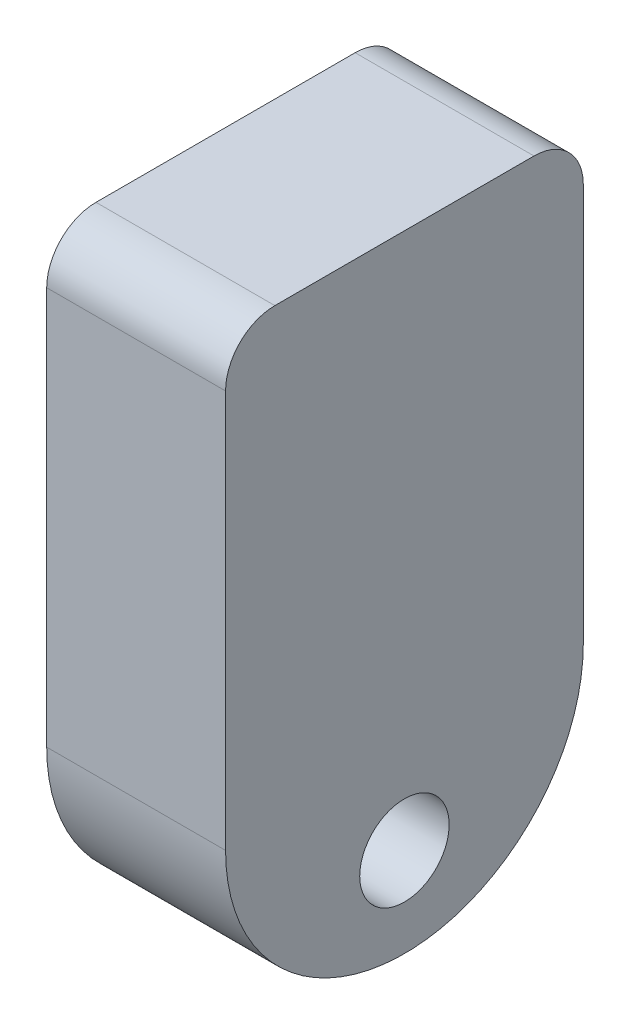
from build123d import *

# Parameters (mm, degrees)
SKETCH1_W               = 50.8
SKETCH1_H               = 88.9
SKETCH1_R               = 6.35
BOSS_EXTRUDE1_DEPTH     = 25.4
BOSS_EXTRUDE2_START     = -1
SKETCH2_R               = 6.35
BOSS_EXTRUDE2_DEPTH     = 1
CUT_EXTRUDE1_DEPTH      = 106.494123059
CUT_EXTRUDE1_DEPTH_BACK = 106.494123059
CUT_EXTRUDE2_DEPTH      = 106.494123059
CUT_EXTRUDE2_DEPTH_BACK = 24.4
FILLET1_R               = 7


with BuildPart() as part:
    # Sketch1 → Boss-Extrude1 (new body)
    with BuildSketch(Plane(origin=(0, 0, 0), x_dir=(0, 0, -1), z_dir=(1, 0, 0))):
        with Locations((25.4, 44.45)):
            Rectangle(SKETCH1_W, SKETCH1_H)
        with Locations((25.4, 63.5)):
            Circle(SKETCH1_R, mode=Mode.SUBTRACT)
    extrude(amount=BOSS_EXTRUDE1_DEPTH)

    # Sketch2 → Boss-Extrude2 (add)
    with BuildSketch(Plane(origin=(25.4, 0, 0), x_dir=(0, 0, -1), z_dir=(1, 0, 0)).offset(BOSS_EXTRUDE2_START)):
        with Locations((25.4, 63.5)):
            Circle(SKETCH2_R)
    extrude(amount=BOSS_EXTRUDE2_DEPTH)

    # Sketch3 → Cut-Extrude1 (cut, two sides: drawn at the far end of the back side and taken through both)
    with BuildSketch(Plane(origin=(25.4, 0, 0), x_dir=(0, 0, -1), z_dir=(1, 0, 0)).offset(-CUT_EXTRUDE1_DEPTH_BACK)):
        with BuildLine():
            Line((50.8, 0), (50.8, 25.4))
            ThreePointArc((50.8, 25.4), (43.360512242, 7.439487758), (25.4, 0))
            Line((25.4, 0), (50.8, 0))
        make_face()
        with BuildLine():
            ThreePointArc((25.4, 0), (7.439487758, 7.439487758), (0, 25.4))
            Line((0, 25.4), (0, 0))
            Line((0, 0), (25.4, 0))
        make_face()
    extrude(amount=CUT_EXTRUDE1_DEPTH + CUT_EXTRUDE1_DEPTH_BACK, mode=Mode.SUBTRACT)

    # Sketch4 → Cut-Extrude2 (cut, two sides: drawn at the far end of the back side and taken through both)
    with BuildSketch(Plane(origin=(25.4, 0, 0), x_dir=(0, 0, -1), z_dir=(1, 0, 0)).offset(-CUT_EXTRUDE2_DEPTH_BACK)):
        with BuildLine():
            ThreePointArc((31.75, 12.7), (29.890128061, 17.190128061), (25.4, 19.05))
            Line((25.4, 19.05), (25.4, 6.35))
            ThreePointArc((25.4, 6.35), (29.890128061, 8.209871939), (31.75, 12.7))
        make_face()
        with BuildLine():
            Line((25.4, 6.35), (25.4, 19.05))
            ThreePointArc((25.4, 19.05), (19.05, 12.7), (25.4, 6.35))
        make_face()
        with BuildLine():
            ThreePointArc((31.75, 12.7), (29.890128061, 17.190128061), (25.4, 19.05))
            Line((25.4, 19.05), (25.4, 6.35))
            ThreePointArc((25.4, 6.35), (29.890128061, 8.209871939), (31.75, 12.7))
        make_face()
        with BuildLine():
            Line((25.4, 6.35), (25.4, 19.05))
            ThreePointArc((25.4, 19.05), (19.05, 12.7), (25.4, 6.35))
        make_face()
    extrude(amount=CUT_EXTRUDE2_DEPTH + CUT_EXTRUDE2_DEPTH_BACK, mode=Mode.SUBTRACT)

    # Fillet1
    fillet1_edges = [part.edges().sort_by_distance(p)[0] for p in [
        (12.7, 88.9, 0),
        (12.7, 88.9, -50.8),
    ]]
    fillet(fillet1_edges, radius=FILLET1_R)


solid = part.part
